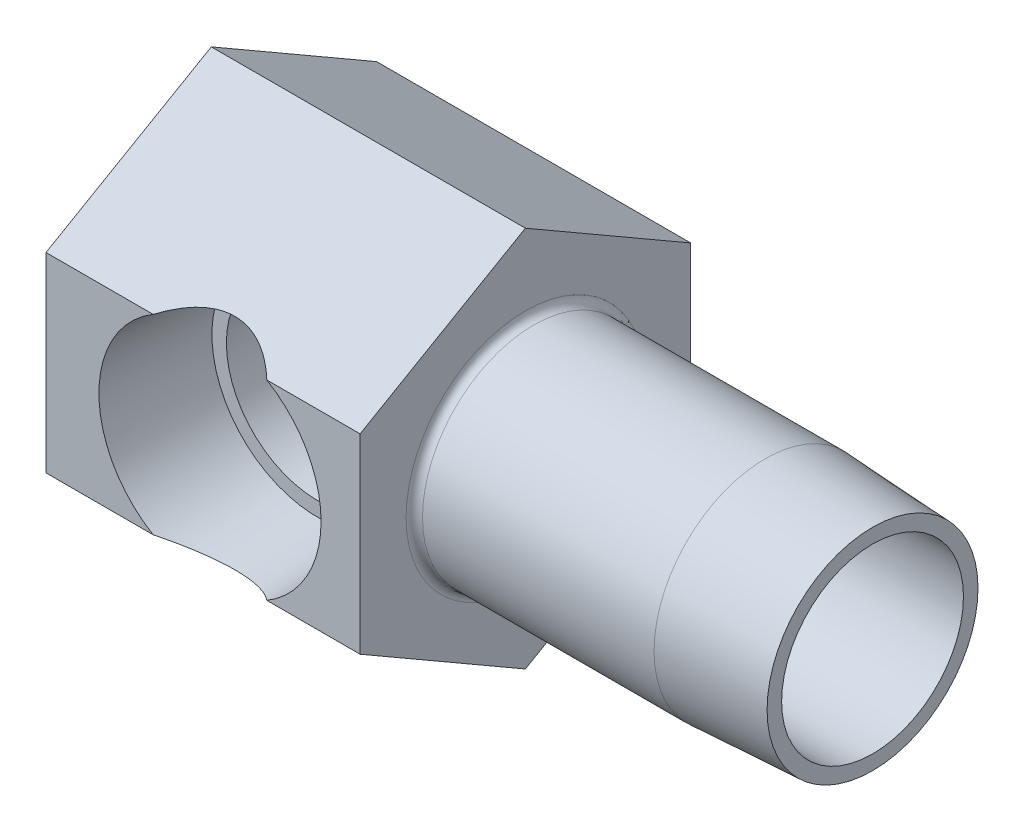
ISO-10303-21;
HEADER;
FILE_DESCRIPTION(('STEP AP214'),'2;1');
FILE_NAME('part.step','',(''),(''),'','','');
FILE_SCHEMA(('AUTOMOTIVE_DESIGN { 1 0 10303 214 1 1 1 1 }'));
ENDSEC;
DATA;
#1=APPLICATION_CONTEXT('core data for automotive mechanical design processes');
#2=APPLICATION_PROTOCOL_DEFINITION('international standard','automotive_design',2000,#1);
#3=PRODUCT_CONTEXT('',#1,'mechanical');
#4=PRODUCT('Part','Part','',(#3));
#5=PRODUCT_RELATED_PRODUCT_CATEGORY('part','',(#4));
#6=PRODUCT_DEFINITION_FORMATION('','',#4);
#7=PRODUCT_DEFINITION_CONTEXT('part definition',#1,'design');
#8=PRODUCT_DEFINITION('design','',#6,#7);
#9=PRODUCT_DEFINITION_SHAPE('','',#8);
#10=(LENGTH_UNIT() NAMED_UNIT(*) SI_UNIT(.MILLI.,.METRE.));
#11=(NAMED_UNIT(*) PLANE_ANGLE_UNIT() SI_UNIT($,.RADIAN.));
#12=(NAMED_UNIT(*) SI_UNIT($,.STERADIAN.) SOLID_ANGLE_UNIT());
#13=UNCERTAINTY_MEASURE_WITH_UNIT(LENGTH_MEASURE(1.E-05),#10,'distance_accuracy_value','');
#14=(GEOMETRIC_REPRESENTATION_CONTEXT(3) GLOBAL_UNCERTAINTY_ASSIGNED_CONTEXT((#13)) GLOBAL_UNIT_ASSIGNED_CONTEXT((#10,
#11,#12)) REPRESENTATION_CONTEXT('',''));
#15=CARTESIAN_POINT('',(0.,0.,0.));
#16=DIRECTION('',(0.,0.,1.));
#17=DIRECTION('',(1.,0.,0.));
#18=AXIS2_PLACEMENT_3D('',#15,#16,#17);
#19=CARTESIAN_POINT('',(63.5,0.,15.875));
#20=DIRECTION('',(-1.,0.,0.));
#21=DIRECTION('',(0.,0.,1.));
#22=AXIS2_PLACEMENT_3D('',#19,#20,#21);
#23=PLANE('',#22);
#24=CARTESIAN_POINT('',(63.5,0.,15.875));
#25=DIRECTION('',(1.,0.,0.));
#26=DIRECTION('',(0.,0.,-1.));
#27=AXIS2_PLACEMENT_3D('',#24,#25,#26);
#28=CIRCLE('',#27,8.73124999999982);
#29=CARTESIAN_POINT('',(63.5,0.,7.14375000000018));
#30=VERTEX_POINT('',#29);
#31=EDGE_CURVE('E520',#30,#30,#28,.T.);
#32=ORIENTED_EDGE('',*,*,#31,.F.);
#33=EDGE_LOOP('',(#32));
#34=FACE_BOUND('',#33,.T.);
#35=CARTESIAN_POINT('',(63.5,0.,15.875));
#36=DIRECTION('',(-1.,0.,0.));
#37=DIRECTION('',(0.,0.,1.));
#38=AXIS2_PLACEMENT_3D('',#35,#36,#37);
#39=CIRCLE('',#38,10.127550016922);
#40=CARTESIAN_POINT('',(63.5,0.,26.002550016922));
#41=VERTEX_POINT('',#40);
#42=EDGE_CURVE('E529',#41,#41,#39,.T.);
#43=ORIENTED_EDGE('',*,*,#42,.F.);
#44=EDGE_LOOP('',(#43));
#45=FACE_BOUND('',#44,.T.);
#46=ADVANCED_FACE('F15',(#34,#45),#23,.F.);
#47=CARTESIAN_POINT('',(30.1625,18.3308710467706,15.875));
#48=DIRECTION('',(0.,-0.866025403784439,-0.5));
#49=DIRECTION('',(0.,0.5,-0.866025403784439));
#50=AXIS2_PLACEMENT_3D('',#47,#48,#49);
#51=PLANE('',#50);
#52=CARTESIAN_POINT('',(15.748,-1.05255916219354,49.4480859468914));
#53=DIRECTION('',(0.,-0.866025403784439,-0.5));
#54=DIRECTION('',(0.,-0.5,0.866025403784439));
#55=AXIS2_PLACEMENT_3D('',#52,#53,#54);
#56=ELLIPSE('',#55,23.191034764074,11.5476466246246);
#57=CARTESIAN_POINT('',(21.2070306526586,9.16543552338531,31.75));
#58=VERTEX_POINT('',#57);
#59=CARTESIAN_POINT('',(10.2889693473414,9.16543552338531,31.75));
#60=VERTEX_POINT('',#59);
#61=EDGE_CURVE('E135',#58,#60,#56,.F.);
#62=ORIENTED_EDGE('',*,*,#61,.F.);
#63=DIRECTION('',(-1.,0.,0.));
#64=VECTOR('',#63,1.);
#65=CARTESIAN_POINT('',(30.1625,9.16543552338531,31.75));
#66=LINE('',#65,#64);
#67=CARTESIAN_POINT('',(30.1625,9.16543552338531,31.75));
#68=VERTEX_POINT('',#67);
#69=EDGE_CURVE('E179',#68,#58,#66,.T.);
#70=ORIENTED_EDGE('',*,*,#69,.F.);
#71=DIRECTION('',(0.,-0.5,0.866025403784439));
#72=VECTOR('',#71,1.);
#73=CARTESIAN_POINT('',(30.1625,18.3308710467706,15.875));
#74=LINE('',#73,#72);
#75=CARTESIAN_POINT('',(30.1625,18.3308710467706,15.875));
#76=VERTEX_POINT('',#75);
#77=EDGE_CURVE('E163',#76,#68,#74,.T.);
#78=ORIENTED_EDGE('',*,*,#77,.F.);
#79=DIRECTION('',(-1.,0.,0.));
#80=VECTOR('',#79,1.);
#81=CARTESIAN_POINT('',(30.1625,18.3308710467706,15.875));
#82=LINE('',#81,#80);
#83=CARTESIAN_POINT('',(0.,18.3308710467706,15.875));
#84=VERTEX_POINT('',#83);
#85=EDGE_CURVE('E182',#76,#84,#82,.T.);
#86=ORIENTED_EDGE('',*,*,#85,.T.);
#87=DIRECTION('',(0.,-0.5,0.866025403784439));
#88=VECTOR('',#87,1.);
#89=CARTESIAN_POINT('',(0.,18.3308710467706,15.875));
#90=LINE('',#89,#88);
#91=CARTESIAN_POINT('',(0.,9.16543552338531,31.75));
#92=VERTEX_POINT('',#91);
#93=EDGE_CURVE('E144',#84,#92,#90,.T.);
#94=ORIENTED_EDGE('',*,*,#93,.T.);
#95=EDGE_CURVE('E178',#60,#92,#66,.T.);
#96=ORIENTED_EDGE('',*,*,#95,.F.);
#97=EDGE_LOOP('',(#62,#70,#78,#86,#94,#96));
#98=FACE_BOUND('',#97,.T.);
#99=ADVANCED_FACE('F210',(#98),#51,.F.);
#100=CARTESIAN_POINT('',(30.1625,9.16543552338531,31.75));
#101=DIRECTION('',(0.,0.,-1.));
#102=DIRECTION('',(-1.,0.,0.));
#103=AXIS2_PLACEMENT_3D('',#100,#101,#102);
#104=PLANE('',#103);
#105=CARTESIAN_POINT('',(15.748,0.,31.75));
#106=DIRECTION('',(0.,0.,-1.));
#107=DIRECTION('',(-1.,0.,0.));
#108=AXIS2_PLACEMENT_3D('',#105,#106,#107);
#109=CIRCLE('',#108,10.668);
#110=CARTESIAN_POINT('',(21.2070306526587,-9.1654355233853,31.75));
#111=VERTEX_POINT('',#110);
#112=EDGE_CURVE('E133',#58,#111,#109,.T.);
#113=ORIENTED_EDGE('',*,*,#112,.T.);
#114=DIRECTION('',(-1.,0.,0.));
#115=VECTOR('',#114,1.);
#116=CARTESIAN_POINT('',(30.1625,-9.1654355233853,31.75));
#117=LINE('',#116,#115);
#118=CARTESIAN_POINT('',(30.1625,-9.1654355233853,31.75));
#119=VERTEX_POINT('',#118);
#120=EDGE_CURVE('E175',#119,#111,#117,.T.);
#121=ORIENTED_EDGE('',*,*,#120,.F.);
#122=DIRECTION('',(0.,-1.,0.));
#123=VECTOR('',#122,1.);
#124=CARTESIAN_POINT('',(30.1625,9.16543552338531,31.75));
#125=LINE('',#124,#123);
#126=EDGE_CURVE('E165',#68,#119,#125,.T.);
#127=ORIENTED_EDGE('',*,*,#126,.F.);
#128=ORIENTED_EDGE('',*,*,#69,.T.);
#129=EDGE_LOOP('',(#113,#121,#127,#128));
#130=FACE_BOUND('',#129,.T.);
#131=ADVANCED_FACE('F206',(#130),#104,.F.);
#132=CARTESIAN_POINT('',(10.2889693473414,-9.1654355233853,31.75));
#133=VERTEX_POINT('',#132);
#134=EDGE_CURVE('E42',#133,#60,#109,.T.);
#135=ORIENTED_EDGE('',*,*,#134,.T.);
#136=ORIENTED_EDGE('',*,*,#95,.T.);
#137=DIRECTION('',(0.,-1.,0.));
#138=VECTOR('',#137,1.);
#139=CARTESIAN_POINT('',(0.,9.16543552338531,31.75));
#140=LINE('',#139,#138);
#141=CARTESIAN_POINT('',(0.,-9.1654355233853,31.75));
#142=VERTEX_POINT('',#141);
#143=EDGE_CURVE('E148',#92,#142,#140,.T.);
#144=ORIENTED_EDGE('',*,*,#143,.T.);
#145=EDGE_CURVE('E174',#133,#142,#117,.T.);
#146=ORIENTED_EDGE('',*,*,#145,.F.);
#147=EDGE_LOOP('',(#135,#136,#144,#146));
#148=FACE_BOUND('',#147,.T.);
#149=ADVANCED_FACE('F213',(#148),#104,.F.);
#150=CARTESIAN_POINT('',(30.1625,-9.1654355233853,31.75));
#151=DIRECTION('',(0.,0.866025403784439,-0.5));
#152=DIRECTION('',(0.,0.5,0.866025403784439));
#153=AXIS2_PLACEMENT_3D('',#150,#151,#152);
#154=PLANE('',#153);
#155=CARTESIAN_POINT('',(15.748,1.05255916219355,49.4480859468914));
#156=DIRECTION('',(0.,0.866025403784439,-0.5));
#157=DIRECTION('',(0.,0.5,0.866025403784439));
#158=AXIS2_PLACEMENT_3D('',#155,#156,#157);
#159=ELLIPSE('',#158,23.191034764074,11.5476466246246);
#160=EDGE_CURVE('E28',#133,#111,#159,.F.);
#161=ORIENTED_EDGE('',*,*,#160,.F.);
#162=ORIENTED_EDGE('',*,*,#145,.T.);
#163=DIRECTION('',(0.,-0.5,-0.866025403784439));
#164=VECTOR('',#163,1.);
#165=CARTESIAN_POINT('',(0.,-9.1654355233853,31.75));
#166=LINE('',#165,#164);
#167=CARTESIAN_POINT('',(0.,-18.3308710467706,15.875));
#168=VERTEX_POINT('',#167);
#169=EDGE_CURVE('E152',#142,#168,#166,.T.);
#170=ORIENTED_EDGE('',*,*,#169,.T.);
#171=DIRECTION('',(-1.,0.,0.));
#172=VECTOR('',#171,1.);
#173=CARTESIAN_POINT('',(30.1625,-18.3308710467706,15.875));
#174=LINE('',#173,#172);
#175=CARTESIAN_POINT('',(30.1625,-18.3308710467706,15.875));
#176=VERTEX_POINT('',#175);
#177=EDGE_CURVE('E169',#176,#168,#174,.T.);
#178=ORIENTED_EDGE('',*,*,#177,.F.);
#179=DIRECTION('',(0.,-0.5,-0.866025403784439));
#180=VECTOR('',#179,1.);
#181=CARTESIAN_POINT('',(30.1625,-9.1654355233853,31.75));
#182=LINE('',#181,#180);
#183=EDGE_CURVE('E167',#119,#176,#182,.T.);
#184=ORIENTED_EDGE('',*,*,#183,.F.);
#185=ORIENTED_EDGE('',*,*,#120,.T.);
#186=EDGE_LOOP('',(#161,#162,#170,#178,#184,#185));
#187=FACE_BOUND('',#186,.T.);
#188=ADVANCED_FACE('F202',(#187),#154,.F.);
#189=CARTESIAN_POINT('',(30.1625,-18.3308710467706,15.875));
#190=DIRECTION('',(0.,0.866025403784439,0.5));
#191=DIRECTION('',(0.,-0.5,0.866025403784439));
#192=AXIS2_PLACEMENT_3D('',#189,#190,#191);
#193=PLANE('',#192);
#194=DIRECTION('',(0.,0.5,-0.866025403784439));
#195=VECTOR('',#194,1.);
#196=CARTESIAN_POINT('',(0.,-18.3308710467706,15.875));
#197=LINE('',#196,#195);
#198=CARTESIAN_POINT('',(0.,-9.16543552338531,0.));
#199=VERTEX_POINT('',#198);
#200=EDGE_CURVE('E137',#168,#199,#197,.T.);
#201=ORIENTED_EDGE('',*,*,#200,.T.);
#202=DIRECTION('',(-1.,0.,0.));
#203=VECTOR('',#202,1.);
#204=CARTESIAN_POINT('',(30.1625,-9.16543552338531,0.));
#205=LINE('',#204,#203);
#206=CARTESIAN_POINT('',(30.1625,-9.16543552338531,0.));
#207=VERTEX_POINT('',#206);
#208=EDGE_CURVE('E188',#207,#199,#205,.T.);
#209=ORIENTED_EDGE('',*,*,#208,.F.);
#210=DIRECTION('',(0.,0.5,-0.866025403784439));
#211=VECTOR('',#210,1.);
#212=CARTESIAN_POINT('',(30.1625,-18.3308710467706,15.875));
#213=LINE('',#212,#211);
#214=EDGE_CURVE('E155',#176,#207,#213,.T.);
#215=ORIENTED_EDGE('',*,*,#214,.F.);
#216=ORIENTED_EDGE('',*,*,#177,.T.);
#217=EDGE_LOOP('',(#201,#209,#215,#216));
#218=FACE_BOUND('',#217,.T.);
#219=ADVANCED_FACE('F220',(#218),#193,.F.);
#220=CARTESIAN_POINT('',(30.1625,-9.16543552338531,0.));
#221=DIRECTION('',(0.,0.,1.));
#222=DIRECTION('',(0.,-1.,0.));
#223=AXIS2_PLACEMENT_3D('',#220,#221,#222);
#224=PLANE('',#223);
#225=DIRECTION('',(0.,1.,0.));
#226=VECTOR('',#225,1.);
#227=CARTESIAN_POINT('',(0.,-9.16543552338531,0.));
#228=LINE('',#227,#226);
#229=CARTESIAN_POINT('',(0.,9.16543552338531,0.));
#230=VERTEX_POINT('',#229);
#231=EDGE_CURVE('E138',#199,#230,#228,.T.);
#232=ORIENTED_EDGE('',*,*,#231,.T.);
#233=DIRECTION('',(-1.,0.,0.));
#234=VECTOR('',#233,1.);
#235=CARTESIAN_POINT('',(30.1625,9.16543552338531,0.));
#236=LINE('',#235,#234);
#237=CARTESIAN_POINT('',(30.1625,9.16543552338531,0.));
#238=VERTEX_POINT('',#237);
#239=EDGE_CURVE('E185',#238,#230,#236,.T.);
#240=ORIENTED_EDGE('',*,*,#239,.F.);
#241=DIRECTION('',(0.,1.,0.));
#242=VECTOR('',#241,1.);
#243=CARTESIAN_POINT('',(30.1625,-9.16543552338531,0.));
#244=LINE('',#243,#242);
#245=EDGE_CURVE('E159',#207,#238,#244,.T.);
#246=ORIENTED_EDGE('',*,*,#245,.F.);
#247=ORIENTED_EDGE('',*,*,#208,.T.);
#248=EDGE_LOOP('',(#232,#240,#246,#247));
#249=FACE_BOUND('',#248,.T.);
#250=ADVANCED_FACE('F227',(#249),#224,.F.);
#251=CARTESIAN_POINT('',(30.1625,9.16543552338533,0.));
#252=DIRECTION('',(0.,-0.86602540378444,0.5));
#253=DIRECTION('',(0.,-0.5,-0.86602540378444));
#254=AXIS2_PLACEMENT_3D('',#251,#252,#253);
#255=PLANE('',#254);
#256=DIRECTION('',(0.,0.5,0.86602540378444));
#257=VECTOR('',#256,1.);
#258=CARTESIAN_POINT('',(0.,9.16543552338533,0.));
#259=LINE('',#258,#257);
#260=EDGE_CURVE('E141',#230,#84,#259,.T.);
#261=ORIENTED_EDGE('',*,*,#260,.T.);
#262=ORIENTED_EDGE('',*,*,#85,.F.);
#263=DIRECTION('',(0.,0.5,0.86602540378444));
#264=VECTOR('',#263,1.);
#265=CARTESIAN_POINT('',(30.1625,9.16543552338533,0.));
#266=LINE('',#265,#264);
#267=EDGE_CURVE('E161',#238,#76,#266,.T.);
#268=ORIENTED_EDGE('',*,*,#267,.F.);
#269=ORIENTED_EDGE('',*,*,#239,.T.);
#270=EDGE_LOOP('',(#261,#262,#268,#269));
#271=FACE_BOUND('',#270,.T.);
#272=ADVANCED_FACE('F233',(#271),#255,.F.);
#273=CARTESIAN_POINT('',(30.1625,-9.16543552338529,0.));
#274=DIRECTION('',(1.,0.,0.));
#275=DIRECTION('',(0.,1.,0.));
#276=AXIS2_PLACEMENT_3D('',#273,#274,#275);
#277=PLANE('',#276);
#278=CARTESIAN_POINT('',(30.1625,0.,15.875));
#279=DIRECTION('',(1.,0.,0.));
#280=DIRECTION('',(0.,1.,0.));
#281=AXIS2_PLACEMENT_3D('',#278,#279,#280);
#282=CIRCLE('',#281,11.4554);
#283=CARTESIAN_POINT('',(30.1625,11.4554,15.875));
#284=VERTEX_POINT('',#283);
#285=EDGE_CURVE('E194',#284,#284,#282,.F.);
#286=ORIENTED_EDGE('',*,*,#285,.T.);
#287=EDGE_LOOP('',(#286));
#288=FACE_BOUND('',#287,.T.);
#289=ORIENTED_EDGE('',*,*,#214,.T.);
#290=ORIENTED_EDGE('',*,*,#245,.T.);
#291=ORIENTED_EDGE('',*,*,#267,.T.);
#292=ORIENTED_EDGE('',*,*,#77,.T.);
#293=ORIENTED_EDGE('',*,*,#126,.T.);
#294=ORIENTED_EDGE('',*,*,#183,.T.);
#295=EDGE_LOOP('',(#289,#290,#291,#292,#293,#294));
#296=FACE_BOUND('',#295,.T.);
#297=ADVANCED_FACE('F230',(#288,#296),#277,.T.);
#298=CARTESIAN_POINT('',(0.,-9.16543552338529,0.));
#299=DIRECTION('',(1.,0.,0.));
#300=DIRECTION('',(0.,1.,0.));
#301=AXIS2_PLACEMENT_3D('',#298,#299,#300);
#302=PLANE('',#301);
#303=ORIENTED_EDGE('',*,*,#200,.F.);
#304=ORIENTED_EDGE('',*,*,#169,.F.);
#305=ORIENTED_EDGE('',*,*,#143,.F.);
#306=ORIENTED_EDGE('',*,*,#93,.F.);
#307=ORIENTED_EDGE('',*,*,#260,.F.);
#308=ORIENTED_EDGE('',*,*,#231,.F.);
#309=EDGE_LOOP('',(#303,#304,#305,#306,#307,#308));
#310=FACE_BOUND('',#309,.T.);
#311=ADVANCED_FACE('F222',(#310),#302,.F.);
#312=CARTESIAN_POINT('',(63.5,0.,15.875));
#313=DIRECTION('',(-1.,0.,0.));
#314=DIRECTION('',(0.,0.,1.));
#315=AXIS2_PLACEMENT_3D('',#312,#313,#314);
#316=CYLINDRICAL_SURFACE('',#315,10.668);
#317=CARTESIAN_POINT('',(53.1876,0.,15.875));
#318=DIRECTION('',(-1.,0.,0.));
#319=DIRECTION('',(0.,0.,1.));
#320=AXIS2_PLACEMENT_3D('',#317,#318,#319);
#321=CIRCLE('',#320,10.6680000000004);
#322=CARTESIAN_POINT('',(53.1876,0.,26.5430000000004));
#323=VERTEX_POINT('',#322);
#324=EDGE_CURVE('E526',#323,#323,#321,.T.);
#325=ORIENTED_EDGE('',*,*,#324,.T.);
#326=EDGE_LOOP('',(#325));
#327=FACE_BOUND('',#326,.T.);
#328=CARTESIAN_POINT('',(30.9499,0.,15.875));
#329=DIRECTION('',(1.,0.,0.));
#330=DIRECTION('',(0.,1.,0.));
#331=AXIS2_PLACEMENT_3D('',#328,#329,#330);
#332=CIRCLE('',#331,10.668);
#333=CARTESIAN_POINT('',(30.9499,10.668,15.875));
#334=VERTEX_POINT('',#333);
#335=EDGE_CURVE('E191',#334,#334,#332,.T.);
#336=ORIENTED_EDGE('',*,*,#335,.T.);
#337=EDGE_LOOP('',(#336));
#338=FACE_BOUND('',#337,.T.);
#339=ADVANCED_FACE('F259',(#327,#338),#316,.T.);
#340=CARTESIAN_POINT('',(30.9499,0.,15.875));
#341=DIRECTION('',(1.,0.,0.));
#342=DIRECTION('',(0.,1.,0.));
#343=AXIS2_PLACEMENT_3D('',#340,#341,#342);
#344=TOROIDAL_SURFACE('',#343,11.4554,0.7874);
#345=ORIENTED_EDGE('',*,*,#285,.F.);
#346=EDGE_LOOP('',(#345));
#347=FACE_BOUND('',#346,.T.);
#348=ORIENTED_EDGE('',*,*,#335,.F.);
#349=EDGE_LOOP('',(#348));
#350=FACE_BOUND('',#349,.T.);
#351=ADVANCED_FACE('F257',(#347,#350),#344,.F.);
#352=CARTESIAN_POINT('',(15.748,0.,31.75));
#353=DIRECTION('',(0.,0.,1.));
#354=DIRECTION('',(1.,0.,0.));
#355=AXIS2_PLACEMENT_3D('',#352,#353,#354);
#356=CONICAL_SURFACE('',#355,10.668,0.0523598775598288);
#357=CARTESIAN_POINT('',(23.3158678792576,-6.73011387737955,21.4374));
#358=CARTESIAN_POINT('',(23.4600282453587,-6.58213571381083,21.6163914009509));
#359=CARTESIAN_POINT('',(23.6023884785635,-6.42627781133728,21.7904706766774));
#360=CARTESIAN_POINT('',(23.8817354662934,-6.09837401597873,22.1280133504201));
#361=CARTESIAN_POINT('',(24.0187135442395,-5.92630339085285,22.2914598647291));
#362=CARTESIAN_POINT('',(24.2862441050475,-5.56440643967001,22.6077795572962));
#363=CARTESIAN_POINT('',(24.4167288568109,-5.37443622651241,22.7605461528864));
#364=CARTESIAN_POINT('',(24.6677167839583,-4.97815123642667,23.0522714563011));
#365=CARTESIAN_POINT('',(24.7882261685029,-4.77184678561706,23.1912387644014));
#366=CARTESIAN_POINT('',(24.9921660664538,-4.38969848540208,23.4250980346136));
#367=CARTESIAN_POINT('',(25.0779672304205,-4.21696245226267,23.5230096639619));
#368=CARTESIAN_POINT('',(25.2408840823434,-3.86199712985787,23.7082473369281));
#369=CARTESIAN_POINT('',(25.3180018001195,-3.67977007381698,23.7955758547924));
#370=CARTESIAN_POINT('',(25.4621670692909,-3.30686520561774,23.9583559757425));
#371=CARTESIAN_POINT('',(25.529240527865,-3.11621083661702,24.0338381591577));
#372=CARTESIAN_POINT('',(25.6523303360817,-2.72696762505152,24.1720474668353));
#373=CARTESIAN_POINT('',(25.7083523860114,-2.52838293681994,24.2347811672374));
#374=CARTESIAN_POINT('',(25.808749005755,-2.12236093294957,24.3470188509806));
#375=CARTESIAN_POINT('',(25.8530023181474,-1.91485526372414,24.3963851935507));
#376=CARTESIAN_POINT('',(25.9281094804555,-1.49442789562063,24.4800766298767));
#377=CARTESIAN_POINT('',(25.9589631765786,-1.2815061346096,24.5144015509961));
#378=CARTESIAN_POINT('',(26.0065047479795,-0.852126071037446,24.5672608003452));
#379=CARTESIAN_POINT('',(26.023192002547,-0.635667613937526,24.5857944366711));
#380=CARTESIAN_POINT('',(26.0419565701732,-0.201352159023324,24.6066338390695));
#381=CARTESIAN_POINT('',(26.0440358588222,0.0165046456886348,24.6089417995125));
#382=CARTESIAN_POINT('',(26.0342583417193,0.421689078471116,24.5980844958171));
#383=CARTESIAN_POINT('',(26.0242658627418,0.609123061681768,24.5869892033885));
#384=CARTESIAN_POINT('',(25.9935596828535,0.982016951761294,24.552869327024));
#385=CARTESIAN_POINT('',(25.9728460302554,1.16747686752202,24.5298447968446));
#386=CARTESIAN_POINT('',(25.9211099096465,1.53498981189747,24.4722733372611));
#387=CARTESIAN_POINT('',(25.8900948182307,1.71704518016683,24.437734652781));
#388=CARTESIAN_POINT('',(25.8183100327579,2.07675633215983,24.3576745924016));
#389=CARTESIAN_POINT('',(25.7775399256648,2.25441192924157,24.3121527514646));
#390=CARTESIAN_POINT('',(25.6868155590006,2.6047674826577,24.2106610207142));
#391=CARTESIAN_POINT('',(25.6368406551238,2.77745527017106,24.1546676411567));
#392=CARTESIAN_POINT('',(25.5285266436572,3.11671661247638,24.0330221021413));
#393=CARTESIAN_POINT('',(25.4701845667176,3.28328797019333,23.9673665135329));
#394=CARTESIAN_POINT('',(25.2834921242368,3.77365322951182,23.7566792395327));
#395=CARTESIAN_POINT('',(25.1436492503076,4.08744436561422,23.5981203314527));
#396=CARTESIAN_POINT('',(24.8735653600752,4.61896069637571,23.289353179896));
#397=CARTESIAN_POINT('',(24.7480029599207,4.84261456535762,23.1450088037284));
#398=CARTESIAN_POINT('',(24.4850001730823,5.27158893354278,22.8402219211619));
#399=CARTESIAN_POINT('',(24.34754826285,5.47689124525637,22.6797637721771));
#400=CARTESIAN_POINT('',(24.0644488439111,5.86754844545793,22.3458754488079));
#401=CARTESIAN_POINT('',(23.918859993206,6.05302358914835,22.1725357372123));
#402=CARTESIAN_POINT('',(23.6957580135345,6.31733501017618,21.90341371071));
#403=CARTESIAN_POINT('',(23.6206767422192,6.40304815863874,21.8122772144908));
#404=CARTESIAN_POINT('',(23.4691939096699,6.56995442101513,21.6270388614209));
#405=CARTESIAN_POINT('',(23.3927925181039,6.65114811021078,21.5329373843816));
#406=CARTESIAN_POINT('',(23.3158678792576,6.73011387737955,21.4374));
#407=B_SPLINE_CURVE_WITH_KNOTS('',3,(#357,#358,#359,#360,#361,#362,#363,#364,#365,#366,#367,
#368,#369,#370,#371,#372,#373,#374,#375,#376,#377,#378,#379,#380,#381,#382,#383,#384,#385,#386,
#387,#388,#389,#390,#391,#392,#393,#394,#395,#396,#397,#398,#399,#400,#401,#402,#403,#404,#405,
#406),.UNSPECIFIED.,.F.,.F.,(4,2,2,2,2,2,2,2,2,2,2,2,2,2,2,2,2,2,2,2,2,2,2,2,4),(0.,
0.820023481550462,1.64131879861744,2.46989520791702,3.29795193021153,3.94627694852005,
4.59445010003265,5.24092150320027,5.8870585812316,6.53961554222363,7.19217999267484,
7.84477303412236,8.49727781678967,9.06067705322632,9.6240737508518,10.187067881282,
10.7500858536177,11.3143822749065,11.8788794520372,13.0099648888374,13.8917191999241,
14.7743379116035,15.65125682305,16.0888974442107,16.5264822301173),.UNSPECIFIED.);
#408=CARTESIAN_POINT('',(23.3160289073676,-6.72994857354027,21.4376));
#409=VERTEX_POINT('',#408);
#410=CARTESIAN_POINT('',(23.3160289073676,6.72994857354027,21.4376));
#411=VERTEX_POINT('',#410);
#412=EDGE_CURVE('E120',#409,#411,#407,.T.);
#413=ORIENTED_EDGE('',*,*,#412,.F.);
#414=CARTESIAN_POINT('',(15.748,0.,21.4376));
#415=DIRECTION('',(0.,0.,-1.));
#416=DIRECTION('',(-1.,0.,0.));
#417=AXIS2_PLACEMENT_3D('',#414,#415,#416);
#418=CIRCLE('',#417,10.1275500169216);
#419=EDGE_CURVE('E122',#409,#411,#418,.T.);
#420=ORIENTED_EDGE('',*,*,#419,.T.);
#421=EDGE_LOOP('',(#413,#420));
#422=FACE_BOUND('',#421,.T.);
#423=ORIENTED_EDGE('',*,*,#61,.T.);
#424=ORIENTED_EDGE('',*,*,#134,.F.);
#425=ORIENTED_EDGE('',*,*,#160,.T.);
#426=ORIENTED_EDGE('',*,*,#112,.F.);
#427=EDGE_LOOP('',(#423,#424,#425,#426));
#428=FACE_BOUND('',#427,.T.);
#429=ADVANCED_FACE('F196',(#422,#428),#356,.F.);
#430=CARTESIAN_POINT('',(25.8755500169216,0.,21.4376));
#431=DIRECTION('',(0.,0.,1.));
#432=DIRECTION('',(1.,0.,0.));
#433=AXIS2_PLACEMENT_3D('',#430,#431,#432);
#434=PLANE('',#433);
#435=DIRECTION('',(1.,0.,0.));
#436=VECTOR('',#435,1.);
#437=CARTESIAN_POINT('',(86.8155901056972,-6.72994857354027,21.4376));
#438=LINE('',#437,#436);
#439=CARTESIAN_POINT('',(21.3205618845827,-6.72994857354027,21.4376));
#440=VERTEX_POINT('',#439);
#441=EDGE_CURVE('E124',#440,#409,#438,.T.);
#442=ORIENTED_EDGE('',*,*,#441,.F.);
#443=CARTESIAN_POINT('',(15.748,0.,21.4376));
#444=DIRECTION('',(0.,0.,-1.));
#445=DIRECTION('',(-1.,0.,0.));
#446=AXIS2_PLACEMENT_3D('',#443,#444,#445);
#447=CIRCLE('',#446,8.7376);
#448=CARTESIAN_POINT('',(21.3205618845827,6.72994857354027,21.4376));
#449=VERTEX_POINT('',#448);
#450=EDGE_CURVE('E116',#440,#449,#447,.T.);
#451=ORIENTED_EDGE('',*,*,#450,.T.);
#452=DIRECTION('',(1.,0.,0.));
#453=VECTOR('',#452,1.);
#454=CARTESIAN_POINT('',(86.8155901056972,6.72994857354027,21.4376));
#455=LINE('',#454,#453);
#456=EDGE_CURVE('E117',#411,#449,#455,.F.);
#457=ORIENTED_EDGE('',*,*,#456,.F.);
#458=ORIENTED_EDGE('',*,*,#419,.F.);
#459=EDGE_LOOP('',(#442,#451,#457,#458));
#460=FACE_BOUND('',#459,.T.);
#461=ADVANCED_FACE('F373',(#460),#434,.T.);
#462=CARTESIAN_POINT('',(15.748,0.,43.0975954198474));
#463=DIRECTION('',(0.,0.,-1.));
#464=DIRECTION('',(-1.,0.,0.));
#465=AXIS2_PLACEMENT_3D('',#462,#463,#464);
#466=CYLINDRICAL_SURFACE('',#465,8.7376);
#467=CARTESIAN_POINT('',(24.4856,0.,7.14375000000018));
#468=CARTESIAN_POINT('',(24.4855979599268,-0.194584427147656,7.14375204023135));
#469=CARTESIAN_POINT('',(24.4790855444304,-0.389211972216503,7.15026918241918));
#470=CARTESIAN_POINT('',(24.4531687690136,-0.776828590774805,7.17620489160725));
#471=CARTESIAN_POINT('',(24.4337566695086,-0.969816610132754,7.19563120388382));
#472=CARTESIAN_POINT('',(24.3824080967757,-1.35279132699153,7.24701779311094));
#473=CARTESIAN_POINT('',(24.3504484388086,-1.54277178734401,7.27900127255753));
#474=CARTESIAN_POINT('',(24.2746397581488,-1.91800162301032,7.3548673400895));
#475=CARTESIAN_POINT('',(24.230784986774,-2.10324866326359,7.39875568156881));
#476=CARTESIAN_POINT('',(24.1323992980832,-2.46629304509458,7.49721818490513));
#477=CARTESIAN_POINT('',(24.0779544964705,-2.64413729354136,7.55170615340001));
#478=CARTESIAN_POINT('',(23.9590478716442,-2.99304779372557,7.6707093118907));
#479=CARTESIAN_POINT('',(23.8945822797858,-3.16411146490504,7.73522827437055));
#480=CARTESIAN_POINT('',(23.7566100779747,-3.49864884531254,7.87331790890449));
#481=CARTESIAN_POINT('',(23.6831076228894,-3.66212599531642,7.94688442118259));
#482=CARTESIAN_POINT('',(23.5279457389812,-3.98115293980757,8.10218588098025));
#483=CARTESIAN_POINT('',(23.4462844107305,-4.13670087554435,8.18392273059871));
#484=CARTESIAN_POINT('',(23.2407563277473,-4.50158308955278,8.38964777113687));
#485=CARTESIAN_POINT('',(23.1132942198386,-4.7068770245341,8.51723745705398));
#486=CARTESIAN_POINT('',(22.84617651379,-5.10080513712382,8.7846388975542));
#487=CARTESIAN_POINT('',(22.7065197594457,-5.28943773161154,8.92445181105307));
#488=CARTESIAN_POINT('',(22.4166157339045,-5.65057111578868,9.21470277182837));
#489=CARTESIAN_POINT('',(22.2663444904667,-5.82303320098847,9.36516487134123));
#490=CARTESIAN_POINT('',(21.9571971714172,-6.15161912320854,9.67473646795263));
#491=CARTESIAN_POINT('',(21.7983210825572,-6.30774293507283,9.83384597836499));
#492=CARTESIAN_POINT('',(21.410466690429,-6.66146937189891,10.2223222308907));
#493=CARTESIAN_POINT('',(21.1781519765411,-6.85174414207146,10.4550504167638));
#494=CARTESIAN_POINT('',(20.7027527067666,-7.20301910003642,10.9314300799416));
#495=CARTESIAN_POINT('',(20.4596630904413,-7.36400534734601,11.1750866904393));
#496=CARTESIAN_POINT('',(19.9655914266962,-7.65767994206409,11.6705392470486));
#497=CARTESIAN_POINT('',(19.7146188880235,-7.79040098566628,11.922325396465));
#498=CARTESIAN_POINT('',(19.2066974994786,-8.0288054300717,12.432296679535));
#499=CARTESIAN_POINT('',(18.9497514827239,-8.13450137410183,12.6904787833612));
#500=CARTESIAN_POINT('',(18.535849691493,-8.28254836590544,13.1070621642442));
#501=CARTESIAN_POINT('',(18.3802144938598,-8.3332845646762,13.2638590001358));
#502=CARTESIAN_POINT('',(18.0678223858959,-8.42559206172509,13.5791092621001));
#503=CARTESIAN_POINT('',(17.9110652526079,-8.46716148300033,13.7375630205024));
#504=CARTESIAN_POINT('',(17.6309955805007,-8.53322740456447,14.0215802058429));
#505=CARTESIAN_POINT('',(17.5077848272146,-8.5594718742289,14.1468425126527));
#506=CARTESIAN_POINT('',(17.2618022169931,-8.60637337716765,14.3980579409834));
#507=CARTESIAN_POINT('',(17.1390302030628,-8.62704779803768,14.5240076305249));
#508=CARTESIAN_POINT('',(16.9357825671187,-8.65687758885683,14.7346643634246));
#509=CARTESIAN_POINT('',(16.8550481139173,-8.66756378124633,14.8189101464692));
#510=CARTESIAN_POINT('',(16.6937016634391,-8.68665280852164,14.9894220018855));
#511=CARTESIAN_POINT('',(16.6130990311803,-8.6950316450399,15.0756998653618));
#512=CARTESIAN_POINT('',(16.4936864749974,-8.70581636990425,15.2075729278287));
#513=CARTESIAN_POINT('',(16.453897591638,-8.70912835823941,15.2522143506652));
#514=CARTESIAN_POINT('',(16.3753514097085,-8.71513811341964,15.3428639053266));
#515=CARTESIAN_POINT('',(16.336600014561,-8.71783283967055,15.3888775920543));
#516=CARTESIAN_POINT('',(16.2623845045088,-8.72252382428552,15.4819945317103));
#517=CARTESIAN_POINT('',(16.2268715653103,-8.72453249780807,15.5290599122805));
#518=CARTESIAN_POINT('',(16.1615894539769,-8.72786360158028,15.6269900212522));
#519=CARTESIAN_POINT('',(16.1317624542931,-8.72919320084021,15.6778082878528));
#520=CARTESIAN_POINT('',(16.106026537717,-8.73026315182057,15.7432733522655));
#521=CARTESIAN_POINT('',(16.1020065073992,-8.73042652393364,15.7545502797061));
#522=CARTESIAN_POINT('',(16.0948910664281,-8.73071197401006,15.7773932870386));
#523=CARTESIAN_POINT('',(16.0917959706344,-8.73083403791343,15.788959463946));
#524=CARTESIAN_POINT('',(16.0842173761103,-8.7311305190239,15.8238300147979));
#525=CARTESIAN_POINT('',(16.0813461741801,-8.7312389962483,15.8475287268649));
#526=CARTESIAN_POINT('',(16.080808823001,-8.73125946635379,15.8951415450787));
#527=CARTESIAN_POINT('',(16.083177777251,-8.73117013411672,15.9190560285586));
#528=CARTESIAN_POINT('',(16.0925113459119,-8.73080677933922,15.9661053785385));
#529=CARTESIAN_POINT('',(16.099514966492,-8.73053118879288,15.9892318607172));
#530=CARTESIAN_POINT('',(16.1262284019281,-8.72942751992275,16.0598051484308));
#531=CARTESIAN_POINT('',(16.151337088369,-8.7283274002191,16.1050597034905));
#532=CARTESIAN_POINT('',(16.2067600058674,-8.72559491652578,16.1922079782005));
#533=CARTESIAN_POINT('',(16.2371111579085,-8.72395869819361,16.2340745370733));
#534=CARTESIAN_POINT('',(16.3394034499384,-8.71784635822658,16.3674166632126));
#535=CARTESIAN_POINT('',(16.4158450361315,-8.71237926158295,16.4553852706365));
#536=CARTESIAN_POINT('',(16.5713693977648,-8.69907947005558,16.6287851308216));
#537=CARTESIAN_POINT('',(16.6504566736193,-8.69124254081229,16.7142115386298));
#538=CARTESIAN_POINT('',(16.8096315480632,-8.67323190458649,16.8834717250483));
#539=CARTESIAN_POINT('',(16.8897156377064,-8.66306494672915,16.9673093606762));
#540=CARTESIAN_POINT('',(17.0502749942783,-8.64038918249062,17.1341543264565));
#541=CARTESIAN_POINT('',(17.1307499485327,-8.62788201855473,17.2171621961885));
#542=CARTESIAN_POINT('',(17.3707828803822,-8.58710464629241,17.463693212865));
#543=CARTESIAN_POINT('',(17.5305844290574,-8.5553951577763,17.626432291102));
#544=CARTESIAN_POINT('',(17.8496978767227,-8.48264950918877,17.9503078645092));
#545=CARTESIAN_POINT('',(18.0090097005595,-8.44161198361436,18.1114441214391));
#546=CARTESIAN_POINT('',(18.4856528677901,-8.30423407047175,18.592695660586));
#547=CARTESIAN_POINT('',(18.8014587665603,-8.1936672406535,18.9104166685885));
#548=CARTESIAN_POINT('',(19.4255974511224,-7.93318916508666,19.5375986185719));
#549=CARTESIAN_POINT('',(19.7339228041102,-7.78324040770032,19.8470513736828));
#550=CARTESIAN_POINT('',(20.3391141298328,-7.44229907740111,20.4540803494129));
#551=CARTESIAN_POINT('',(20.6359893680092,-7.25134054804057,20.7516661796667));
#552=CARTESIAN_POINT('',(21.1000219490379,-6.910044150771,21.2166598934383));
#553=CARTESIAN_POINT('',(21.2721889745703,-6.7733595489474,21.3891483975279));
#554=CARTESIAN_POINT('',(21.6095045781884,-6.48366113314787,21.7270430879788));
#555=CARTESIAN_POINT('',(21.7746536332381,-6.33064843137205,21.8924497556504));
#556=CARTESIAN_POINT('',(22.2570327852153,-5.84682072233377,22.3755293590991));
#557=CARTESIAN_POINT('',(22.5620480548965,-5.49060305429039,22.6809166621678));
#558=CARTESIAN_POINT('',(23.069916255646,-4.78392446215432,23.1893448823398));
#559=CARTESIAN_POINT('',(23.2811256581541,-4.44561570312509,23.4007639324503));
#560=CARTESIAN_POINT('',(23.5668242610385,-3.90553017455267,23.6867285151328));
#561=CARTESIAN_POINT('',(23.6568667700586,-3.72007663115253,23.7768515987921));
#562=CARTESIAN_POINT('',(23.8252338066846,-3.33876204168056,23.9453649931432));
#563=CARTESIAN_POINT('',(23.9035605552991,-3.14290297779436,24.0237575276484));
#564=CARTESIAN_POINT('',(24.0342740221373,-2.77741093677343,24.1545782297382));
#565=CARTESIAN_POINT('',(24.0887969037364,-2.60930304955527,24.2091448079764));
#566=CARTESIAN_POINT('',(24.1881404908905,-2.26745357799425,24.3085667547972));
#567=CARTESIAN_POINT('',(24.232963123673,-2.0937131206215,24.3534240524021));
#568=CARTESIAN_POINT('',(24.3121701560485,-1.74160557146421,24.4326916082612));
#569=CARTESIAN_POINT('',(24.3465592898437,-1.5632406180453,24.4671066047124));
#570=CARTESIAN_POINT('',(24.4043171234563,-1.20295803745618,24.5249075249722));
#571=CARTESIAN_POINT('',(24.427685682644,-1.02104036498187,24.548293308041));
#572=CARTESIAN_POINT('',(24.463023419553,-0.654283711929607,24.5836569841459));
#573=CARTESIAN_POINT('',(24.4749486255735,-0.46943621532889,24.5955908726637));
#574=CARTESIAN_POINT('',(24.4870048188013,-0.0989697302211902,24.6076558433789));
#575=CARTESIAN_POINT('',(24.4871357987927,0.086649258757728,24.6077869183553));
#576=CARTESIAN_POINT('',(24.4756009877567,0.457153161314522,24.59624371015));
#577=CARTESIAN_POINT('',(24.4639348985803,0.642038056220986,24.5845691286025));
#578=CARTESIAN_POINT('',(24.4290390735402,1.00960102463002,24.5496476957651));
#579=CARTESIAN_POINT('',(24.4058095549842,1.19227913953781,24.5264010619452));
#580=CARTESIAN_POINT('',(24.3499037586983,1.5435978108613,24.4704535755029));
#581=CARTESIAN_POINT('',(24.3178522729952,1.71243875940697,24.4383780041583));
#582=CARTESIAN_POINT('',(24.2443827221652,2.0460500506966,24.3648524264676));
#583=CARTESIAN_POINT('',(24.2029611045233,2.21081882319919,24.3233988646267));
#584=CARTESIAN_POINT('',(24.1113637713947,2.53539687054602,24.231729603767));
#585=CARTESIAN_POINT('',(24.0611880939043,2.69520616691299,24.1815139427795));
#586=CARTESIAN_POINT('',(23.9527394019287,3.0092382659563,24.0729769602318));
#587=CARTESIAN_POINT('',(23.8944647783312,3.16345995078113,24.0146540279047));
#588=CARTESIAN_POINT('',(23.7478576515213,3.52103226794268,23.8679223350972));
#589=CARTESIAN_POINT('',(23.6563189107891,3.72176242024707,23.776303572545));
#590=CARTESIAN_POINT('',(23.4611265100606,4.11105686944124,23.5809334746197));
#591=CARTESIAN_POINT('',(23.3574693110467,4.29961758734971,23.4771785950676));
#592=CARTESIAN_POINT('',(23.1395028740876,4.66439092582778,23.2589969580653));
#593=CARTESIAN_POINT('',(23.0251788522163,4.84058579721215,23.1445553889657));
#594=CARTESIAN_POINT('',(22.7874660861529,5.18020722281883,22.9065848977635));
#595=CARTESIAN_POINT('',(22.6640769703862,5.34363325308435,22.7830556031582));
#596=CARTESIAN_POINT('',(22.3624933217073,5.71583582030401,22.4811084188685));
#597=CARTESIAN_POINT('',(22.1808835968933,5.9190794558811,22.2992637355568));
#598=CARTESIAN_POINT('',(21.8058537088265,6.30238103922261,21.9236994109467));
#599=CARTESIAN_POINT('',(21.6124292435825,6.48243046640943,21.7299754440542));
#600=CARTESIAN_POINT('',(21.2157200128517,6.8203891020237,21.3325794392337));
#601=CARTESIAN_POINT('',(21.0124171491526,6.97825543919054,21.1288891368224));
#602=CARTESIAN_POINT('',(20.5982380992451,7.27223101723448,20.7138083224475));
#603=CARTESIAN_POINT('',(20.3873623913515,7.40834162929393,20.5024182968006));
#604=CARTESIAN_POINT('',(19.884649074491,7.70363293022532,19.9982794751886));
#605=CARTESIAN_POINT('',(19.59030513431,7.85421669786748,19.7029484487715));
#606=CARTESIAN_POINT('',(19.1430322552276,8.05270383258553,19.2536843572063));
#607=CARTESIAN_POINT('',(18.9929116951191,8.11432340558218,19.1028145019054));
#608=CARTESIAN_POINT('',(18.6911065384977,8.2285969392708,18.7992470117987));
#609=CARTESIAN_POINT('',(18.5394220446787,8.28125148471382,18.6465494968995));
#610=CARTESIAN_POINT('',(18.2352261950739,8.37763466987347,18.3399014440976));
#611=CARTESIAN_POINT('',(18.0827174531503,8.42138304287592,18.1859544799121));
#612=CARTESIAN_POINT('',(17.7769311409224,8.5002358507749,17.8765529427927));
#613=CARTESIAN_POINT('',(17.6236534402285,8.53533876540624,17.721098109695));
#614=CARTESIAN_POINT('',(17.3172180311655,8.59695458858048,17.4087584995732));
#615=CARTESIAN_POINT('',(17.164060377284,8.62347694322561,17.2518754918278));
#616=CARTESIAN_POINT('',(16.8589569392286,8.66804695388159,16.935768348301));
#617=CARTESIAN_POINT('',(16.7070105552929,8.68609909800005,16.7765454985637));
#618=CARTESIAN_POINT('',(16.46350407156,8.70877341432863,16.5098735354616));
#619=CARTESIAN_POINT('',(16.3699008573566,8.71589085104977,16.4044258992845));
#620=CARTESIAN_POINT('',(16.2323264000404,8.72430499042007,16.2291085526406));
#621=CARTESIAN_POINT('',(16.1841543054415,8.72679002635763,16.163138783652));
#622=CARTESIAN_POINT('',(16.133496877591,8.729101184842,16.0698810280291));
#623=CARTESIAN_POINT('',(16.1225051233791,8.72957575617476,16.0475182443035));
#624=CARTESIAN_POINT('',(16.1036531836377,8.73036364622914,16.0015173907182));
#625=CARTESIAN_POINT('',(16.0957832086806,8.73067746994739,15.9778835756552));
#626=CARTESIAN_POINT('',(16.0858252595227,8.73106804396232,15.9345234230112));
#627=CARTESIAN_POINT('',(16.0828762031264,8.73118048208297,15.9150042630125));
#628=CARTESIAN_POINT('',(16.0804848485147,8.73127193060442,15.8757632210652));
#629=CARTESIAN_POINT('',(16.0810378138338,8.73125112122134,15.8560416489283));
#630=CARTESIAN_POINT('',(16.085496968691,8.73107971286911,15.8170943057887));
#631=CARTESIAN_POINT('',(16.0893884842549,8.7309296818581,15.7978667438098));
#632=CARTESIAN_POINT('',(16.0998433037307,8.73051484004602,15.7601398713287));
#633=CARTESIAN_POINT('',(16.1064126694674,8.73024976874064,15.7416423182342));
#634=CARTESIAN_POINT('',(16.1364699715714,8.72898749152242,15.6687660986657));
#635=CARTESIAN_POINT('',(16.167275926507,8.72759479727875,15.6175941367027));
#636=CARTESIAN_POINT('',(16.2343481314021,8.72412321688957,15.51885530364));
#637=CARTESIAN_POINT('',(16.2706691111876,8.72203717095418,15.4713327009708));
#638=CARTESIAN_POINT('',(16.3943809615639,8.71408023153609,15.3171540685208));
#639=CARTESIAN_POINT('',(16.4865189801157,8.70682435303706,15.2143256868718));
#640=CARTESIAN_POINT('',(16.6731786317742,8.68900060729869,15.0111482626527));
#641=CARTESIAN_POINT('',(16.7677038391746,8.67842746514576,14.9108034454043));
#642=CARTESIAN_POINT('',(16.9573900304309,8.65402061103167,14.7119565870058));
#643=CARTESIAN_POINT('',(17.0525458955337,8.64020255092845,14.6134480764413));
#644=CARTESIAN_POINT('',(17.2430914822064,8.60927992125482,14.4173129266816));
#645=CARTESIAN_POINT('',(17.3384810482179,8.59217714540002,14.3196858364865));
#646=CARTESIAN_POINT('',(17.7459864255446,8.51203730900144,13.9038911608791));
#647=CARTESIAN_POINT('',(18.0580987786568,8.43292269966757,13.5886112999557));
#648=CARTESIAN_POINT('',(18.6776048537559,8.23825366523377,12.9641986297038));
#649=CARTESIAN_POINT('',(18.9849941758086,8.1226671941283,12.655071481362));
#650=CARTESIAN_POINT('',(19.5923220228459,7.85348929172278,12.0450114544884));
#651=CARTESIAN_POINT('',(19.8922482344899,7.6998391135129,11.744092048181));
#652=CARTESIAN_POINT('',(20.4804833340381,7.35294307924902,11.1542044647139));
#653=CARTESIAN_POINT('',(20.7688011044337,7.15972821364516,10.865227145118));
#654=CARTESIAN_POINT('',(21.2206780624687,6.81483228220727,10.4124550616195));
#655=CARTESIAN_POINT('',(21.3891940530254,6.67617271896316,10.2436383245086));
#656=CARTESIAN_POINT('',(21.7190895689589,6.38282740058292,9.91319894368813));
#657=CARTESIAN_POINT('',(21.8804695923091,6.22814276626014,9.75157579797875));
#658=CARTESIAN_POINT('',(22.3513310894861,5.73984762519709,9.28005235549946));
#659=CARTESIAN_POINT('',(22.6484248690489,5.38133142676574,8.9826055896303));
#660=CARTESIAN_POINT('',(23.141492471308,4.67228730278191,8.48900613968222));
#661=CARTESIAN_POINT('',(23.3459092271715,4.33363653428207,8.2843900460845));
#662=CARTESIAN_POINT('',(23.62145792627,3.79409663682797,8.00858862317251));
#663=CARTESIAN_POINT('',(23.7081391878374,3.60895802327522,7.92183082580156));
#664=CARTESIAN_POINT('',(23.8698120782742,3.2286920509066,7.76001907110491));
#665=CARTESIAN_POINT('',(23.9448062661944,3.03356689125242,7.68496255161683));
#666=CARTESIAN_POINT('',(24.0697191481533,2.66926471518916,7.55994813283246));
#667=CARTESIAN_POINT('',(24.1217294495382,2.50151910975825,7.50789648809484));
#668=CARTESIAN_POINT('',(24.2160793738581,2.16067893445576,7.41347268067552));
#669=CARTESIAN_POINT('',(24.2584209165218,1.98758543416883,7.37109859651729));
#670=CARTESIAN_POINT('',(24.3326749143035,1.63737162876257,7.29678816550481));
#671=CARTESIAN_POINT('',(24.3646094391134,1.46026070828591,7.26482973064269));
#672=CARTESIAN_POINT('',(24.4175977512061,1.10287331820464,7.21180203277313));
#673=CARTESIAN_POINT('',(24.4386569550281,0.922598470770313,7.1907273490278));
#674=CARTESIAN_POINT('',(24.4645620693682,0.61842168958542,7.16480325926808));
#675=CARTESIAN_POINT('',(24.472443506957,0.495022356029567,7.15691607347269));
#676=CARTESIAN_POINT('',(24.48296362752,0.247754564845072,7.14638828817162));
#677=CARTESIAN_POINT('',(24.4856012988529,0.123886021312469,7.14374870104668));
#678=CARTESIAN_POINT('',(24.4856,0.,7.14375000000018));
#679=B_SPLINE_CURVE_WITH_KNOTS('',3,(#467,#468,#469,#470,#471,#472,#473,#474,#475,#476,#477,
#478,#479,#480,#481,#482,#483,#484,#485,#486,#487,#488,#489,#490,#491,#492,#493,#494,#495,#496,
#497,#498,#499,#500,#501,#502,#503,#504,#505,#506,#507,#508,#509,#510,#511,#512,#513,#514,#515,
#516,#517,#518,#519,#520,#521,#522,#523,#524,#525,#526,#527,#528,#529,#530,#531,#532,#533,#534,
#535,#536,#537,#538,#539,#540,#541,#542,#543,#544,#545,#546,#547,#548,#549,#550,#551,#552,#553,
#554,#555,#556,#557,#558,#559,#560,#561,#562,#563,#564,#565,#566,#567,#568,#569,#570,#571,#572,
#573,#574,#575,#576,#577,#578,#579,#580,#581,#582,#583,#584,#585,#586,#587,#588,#589,#590,#591,
#592,#593,#594,#595,#596,#597,#598,#599,#600,#601,#602,#603,#604,#605,#606,#607,#608,#609,#610,
#611,#612,#613,#614,#615,#616,#617,#618,#619,#620,#621,#622,#623,#624,#625,#626,#627,#628,#629,
#630,#631,#632,#633,#634,#635,#636,#637,#638,#639,#640,#641,#642,#643,#644,#645,#646,#647,#648,
#649,#650,#651,#652,#653,#654,#655,#656,#657,#658,#659,#660,#661,#662,#663,#664,#665,#666,#667,
#668,#669,#670,#671,#672,#673,#674,#675,#676,#677,#678),.UNSPECIFIED.,.T.,.F.,(4,2,2,2,2,2,2,2,
2,2,2,2,2,2,2,2,2,2,2,2,2,2,2,2,2,2,2,2,2,2,2,2,2,2,2,2,2,2,2,2,2,2,2,2,2,2,2,2,2,2,2,2,2,2,2,2,
2,2,2,2,2,2,2,2,2,2,2,2,2,2,2,2,2,2,2,2,2,2,2,2,2,2,2,2,2,2,2,2,2,2,2,2,2,2,2,2,2,2,2,2,2,2,2,2,
2,4),(0.,0.583612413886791,1.16757530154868,1.75262232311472,2.3379525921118,2.91870833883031,
3.49968302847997,4.08039159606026,4.66123567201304,5.47979311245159,6.29842824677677,
7.11897529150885,7.93952359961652,9.07759978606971,10.2162162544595,11.3535083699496,
12.4902716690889,13.1701291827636,13.85012577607,14.3830023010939,14.9141955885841,
15.2656970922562,15.62072714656,15.8004033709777,15.9809464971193,16.1580238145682,
16.3331909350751,16.3690696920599,16.4049606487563,16.4760278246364,16.5475725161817,
16.61972713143,16.7737867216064,16.9289791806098,17.2784485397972,17.6285460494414,
17.9776420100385,18.3264938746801,19.0170858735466,19.7077790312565,21.0901665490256,
22.4738756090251,23.8564404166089,24.6940964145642,25.5316953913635,27.2028655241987,
28.5515700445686,29.225841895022,29.8999857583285,30.4543223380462,31.0085486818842,
31.5625231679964,32.1165047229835,32.67260655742,33.2287087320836,33.7848249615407,
34.3409307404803,34.8648402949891,35.3889488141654,35.9130550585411,36.4372655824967,
37.1528654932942,37.8686749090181,38.5854915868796,39.3023376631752,40.2838426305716,
41.265707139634,42.2494438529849,43.2331185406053,44.5610507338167,45.2256261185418,
45.8901581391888,46.5532013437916,47.2163610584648,47.8787882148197,48.5408639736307,
48.964542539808,49.208361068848,49.2829836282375,49.3573702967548,49.4163167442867,
49.4751834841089,49.5337928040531,49.5925355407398,49.7702540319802,49.949867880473,
50.3640564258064,50.7789069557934,51.1917961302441,51.6044604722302,52.9547097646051,
54.3061487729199,55.6596867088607,57.0121684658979,57.8392729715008,58.6663196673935,
60.3161744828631,61.6467920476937,62.3123085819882,62.9776791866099,63.5266629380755,
64.0755375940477,64.6232405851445,65.1706705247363,65.5421672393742,65.9137356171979),.UNSPECIFIED.);
#680=CARTESIAN_POINT('',(23.410585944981,-4.1988606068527,8.21965571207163));
#681=VERTEX_POINT('',#680);
#682=EDGE_CURVE('E106',#681,#440,#679,.T.);
#683=ORIENTED_EDGE('',*,*,#682,.F.);
#684=CARTESIAN_POINT('',(15.748,0.,8.21965571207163));
#685=DIRECTION('',(0.,0.,-1.));
#686=DIRECTION('',(-1.,0.,0.));
#687=AXIS2_PLACEMENT_3D('',#684,#685,#686);
#688=CIRCLE('',#687,8.7376);
#689=CARTESIAN_POINT('',(23.410585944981,4.19886060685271,8.21965571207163));
#690=VERTEX_POINT('',#689);
#691=EDGE_CURVE('E114',#681,#690,#688,.T.);
#692=ORIENTED_EDGE('',*,*,#691,.T.);
#693=EDGE_CURVE('E34',#449,#690,#679,.T.);
#694=ORIENTED_EDGE('',*,*,#693,.F.);
#695=ORIENTED_EDGE('',*,*,#450,.F.);
#696=EDGE_LOOP('',(#683,#692,#694,#695));
#697=FACE_BOUND('',#696,.T.);
#698=ADVANCED_FACE('F113',(#697),#466,.F.);
#699=CARTESIAN_POINT('',(15.748,0.,8.21965571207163));
#700=DIRECTION('',(0.,0.,1.));
#701=DIRECTION('',(1.,0.,0.));
#702=AXIS2_PLACEMENT_3D('',#699,#700,#701);
#703=CONICAL_SURFACE('',#702,8.7376,1.0471975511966);
#704=CARTESIAN_POINT('',(23.4107811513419,4.19922522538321,8.21985571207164));
#705=CARTESIAN_POINT('',(23.367919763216,4.11919395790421,8.17595278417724));
#706=CARTESIAN_POINT('',(23.3270293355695,4.03767589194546,8.13287159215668));
#707=CARTESIAN_POINT('',(23.2492204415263,3.8718198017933,8.04860939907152));
#708=CARTESIAN_POINT('',(23.2123017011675,3.78748197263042,8.00742826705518));
#709=CARTESIAN_POINT('',(23.1076914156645,3.53082485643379,7.8872854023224));
#710=CARTESIAN_POINT('',(23.0459592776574,3.35451271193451,7.81153115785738));
#711=CARTESIAN_POINT('',(22.9381824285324,2.9949771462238,7.67123528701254));
#712=CARTESIAN_POINT('',(22.8919973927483,2.81183308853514,7.60659608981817));
#713=CARTESIAN_POINT('',(22.8127166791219,2.43901153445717,7.48904901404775));
#714=CARTESIAN_POINT('',(22.7796265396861,2.24933131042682,7.43614610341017));
#715=CARTESIAN_POINT('',(22.7225896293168,1.85315874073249,7.34009061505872));
#716=CARTESIAN_POINT('',(22.6993570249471,1.64636373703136,7.29777066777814));
#717=CARTESIAN_POINT('',(22.6626845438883,1.22942523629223,7.2281547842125));
#718=CARTESIAN_POINT('',(22.6492454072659,1.01928148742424,7.20085998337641));
#719=CARTESIAN_POINT('',(22.6302721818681,0.596327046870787,7.16153764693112));
#720=CARTESIAN_POINT('',(22.6247719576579,0.383508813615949,7.14957553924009));
#721=CARTESIAN_POINT('',(22.6209210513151,-0.0424818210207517,7.14125475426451));
#722=CARTESIAN_POINT('',(22.6225699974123,-0.255654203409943,7.14489526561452));
#723=CARTESIAN_POINT('',(22.6333383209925,-0.68327243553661,7.16786503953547));
#724=CARTESIAN_POINT('',(22.6425377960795,-0.897707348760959,7.18736249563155));
#725=CARTESIAN_POINT('',(22.6699228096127,-1.3240495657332,7.24205141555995));
#726=CARTESIAN_POINT('',(22.6881097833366,-1.53595646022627,7.27724538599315));
#727=CARTESIAN_POINT('',(22.7356881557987,-1.95439228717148,7.362629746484));
#728=CARTESIAN_POINT('',(22.765024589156,-2.16094237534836,7.41274631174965));
#729=CARTESIAN_POINT('',(22.8376796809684,-2.56751673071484,7.52712041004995));
#730=CARTESIAN_POINT('',(22.8809887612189,-2.76754536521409,7.59136824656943));
#731=CARTESIAN_POINT('',(22.9613447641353,-3.07251528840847,7.70138682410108));
#732=CARTESIAN_POINT('',(22.9927516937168,-3.18054225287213,7.74283631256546));
#733=CARTESIAN_POINT('',(23.0610067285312,-3.39337844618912,7.82932474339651));
#734=CARTESIAN_POINT('',(23.0978536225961,-3.49818838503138,7.87436288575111));
#735=CARTESIAN_POINT('',(23.1773744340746,-3.70471548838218,7.9678691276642));
#736=CARTESIAN_POINT('',(23.2200768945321,-3.80641431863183,8.01635343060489));
#737=CARTESIAN_POINT('',(23.3111685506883,-4.00587016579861,8.11612059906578));
#738=CARTESIAN_POINT('',(23.3595598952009,-4.10362567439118,8.16740451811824));
#739=CARTESIAN_POINT('',(23.4107811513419,-4.19922522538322,8.21985571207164));
#740=B_SPLINE_CURVE_WITH_KNOTS('',3,(#704,#705,#706,#707,#708,#709,#710,#711,#712,#713,#714,
#715,#716,#717,#718,#719,#720,#721,#722,#723,#724,#725,#726,#727,#728,#729,#730,#731,#732,#733,
#734,#735,#736,#737,#738,#739),.UNSPECIFIED.,.F.,.F.,(4,2,2,2,2,2,2,2,2,2,2,2,2,2,2,2,2,4),(0.,
0.302467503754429,0.604914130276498,1.20849247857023,1.8064670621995,2.40469428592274,
3.04091498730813,3.67718376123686,4.31615869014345,4.9551003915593,5.60090908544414,
6.24682094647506,6.88958900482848,7.53191738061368,7.89140548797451,8.25081367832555,
8.61204058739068,8.97340438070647),.UNSPECIFIED.);
#741=EDGE_CURVE('E10',#690,#681,#740,.T.);
#742=ORIENTED_EDGE('',*,*,#741,.F.);
#743=ORIENTED_EDGE('',*,*,#691,.F.);
#744=EDGE_LOOP('',(#742,#743));
#745=FACE_BOUND('',#744,.T.);
#746=CARTESIAN_POINT('',(15.748,0.,3.17500000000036));
#747=VERTEX_POINT('',#746);
#748=VERTEX_LOOP('',#747);
#749=FACE_BOUND('',#748,.T.);
#750=ADVANCED_FACE('F17',(#745,#749),#703,.F.);
#751=CARTESIAN_POINT('',(86.8155901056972,0.,15.875));
#752=DIRECTION('',(1.,0.,0.));
#753=DIRECTION('',(0.,0.,-1.));
#754=AXIS2_PLACEMENT_3D('',#751,#752,#753);
#755=CYLINDRICAL_SURFACE('',#754,8.73124999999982);
#756=ORIENTED_EDGE('',*,*,#412,.T.);
#757=ORIENTED_EDGE('',*,*,#456,.T.);
#758=ORIENTED_EDGE('',*,*,#693,.T.);
#759=ORIENTED_EDGE('',*,*,#741,.T.);
#760=ORIENTED_EDGE('',*,*,#682,.T.);
#761=ORIENTED_EDGE('',*,*,#441,.T.);
#762=EDGE_LOOP('',(#756,#757,#758,#759,#760,#761));
#763=FACE_BOUND('',#762,.T.);
#764=ORIENTED_EDGE('',*,*,#31,.T.);
#765=EDGE_LOOP('',(#764));
#766=FACE_BOUND('',#765,.T.);
#767=ADVANCED_FACE('F104',(#763,#766),#755,.F.);
#768=CARTESIAN_POINT('',(63.5,0.,15.875));
#769=DIRECTION('',(-1.,0.,0.));
#770=DIRECTION('',(0.,0.,1.));
#771=AXIS2_PLACEMENT_3D('',#768,#769,#770);
#772=CONICAL_SURFACE('',#771,10.127550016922,0.0523598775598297);
#773=ORIENTED_EDGE('',*,*,#324,.F.);
#774=EDGE_LOOP('',(#773));
#775=FACE_BOUND('',#774,.T.);
#776=ORIENTED_EDGE('',*,*,#42,.T.);
#777=EDGE_LOOP('',(#776));
#778=FACE_BOUND('',#777,.T.);
#779=ADVANCED_FACE('F404',(#775,#778),#772,.T.);
#780=CLOSED_SHELL('',(#46,#99,#131,#149,#188,#219,#250,#272,#297,#311,#339,#351,#429,#461,#698,
#750,#767,#779));
#781=MANIFOLD_SOLID_BREP('B1',#780);
#782=ADVANCED_BREP_SHAPE_REPRESENTATION('',(#18,#781),#14);
#783=SHAPE_DEFINITION_REPRESENTATION(#9,#782);
ENDSEC;
END-ISO-10303-21;
